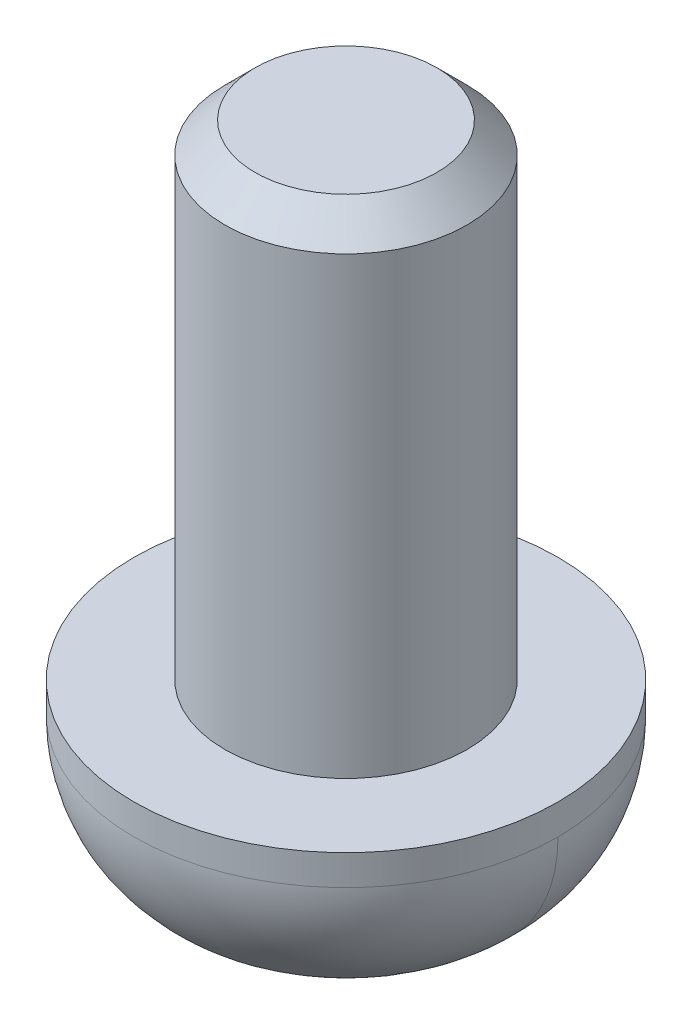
ISO-10303-21;
HEADER;
FILE_DESCRIPTION(('STEP AP214'),'2;1');
FILE_NAME('part.step','',(''),(''),'','','');
FILE_SCHEMA(('AUTOMOTIVE_DESIGN { 1 0 10303 214 1 1 1 1 }'));
ENDSEC;
DATA;
#1=APPLICATION_CONTEXT('core data for automotive mechanical design processes');
#2=APPLICATION_PROTOCOL_DEFINITION('international standard','automotive_design',2000,#1);
#3=PRODUCT_CONTEXT('',#1,'mechanical');
#4=PRODUCT('Part','Part','',(#3));
#5=PRODUCT_RELATED_PRODUCT_CATEGORY('part','',(#4));
#6=PRODUCT_DEFINITION_FORMATION('','',#4);
#7=PRODUCT_DEFINITION_CONTEXT('part definition',#1,'design');
#8=PRODUCT_DEFINITION('design','',#6,#7);
#9=PRODUCT_DEFINITION_SHAPE('','',#8);
#10=(LENGTH_UNIT() NAMED_UNIT(*) SI_UNIT(.MILLI.,.METRE.));
#11=(NAMED_UNIT(*) PLANE_ANGLE_UNIT() SI_UNIT($,.RADIAN.));
#12=(NAMED_UNIT(*) SI_UNIT($,.STERADIAN.) SOLID_ANGLE_UNIT());
#13=UNCERTAINTY_MEASURE_WITH_UNIT(LENGTH_MEASURE(1.E-05),#10,'distance_accuracy_value','');
#14=(GEOMETRIC_REPRESENTATION_CONTEXT(3) GLOBAL_UNCERTAINTY_ASSIGNED_CONTEXT((#13)) GLOBAL_UNIT_ASSIGNED_CONTEXT((#10,
#11,#12)) REPRESENTATION_CONTEXT('',''));
#15=CARTESIAN_POINT('',(0.,0.,0.));
#16=DIRECTION('',(0.,0.,1.));
#17=DIRECTION('',(1.,0.,0.));
#18=AXIS2_PLACEMENT_3D('',#15,#16,#17);
#19=CARTESIAN_POINT('',(-17.359,89.3,19.441));
#20=DIRECTION('',(0.,1.,0.));
#21=DIRECTION('',(0.,0.,1.));
#22=AXIS2_PLACEMENT_3D('',#19,#20,#21);
#23=PLANE('',#22);
#24=CARTESIAN_POINT('',(-16.6,89.3,20.2));
#25=DIRECTION('',(0.,-1.,0.));
#26=DIRECTION('',(0.,0.,-1.));
#27=AXIS2_PLACEMENT_3D('',#24,#25,#26);
#28=CIRCLE('',#27,0.749999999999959);
#29=CARTESIAN_POINT('',(-16.6,89.3,19.45));
#30=VERTEX_POINT('',#29);
#31=EDGE_CURVE('E22',#30,#30,#28,.F.);
#32=ORIENTED_EDGE('',*,*,#31,.T.);
#33=EDGE_LOOP('',(#32));
#34=FACE_BOUND('',#33,.T.);
#35=ADVANCED_FACE('F17',(#34),#23,.T.);
#36=CARTESIAN_POINT('',(-16.6,89.3,20.2));
#37=DIRECTION('',(0.,-1.,0.));
#38=DIRECTION('',(0.,0.,-1.));
#39=AXIS2_PLACEMENT_3D('',#36,#37,#38);
#40=CONICAL_SURFACE('',#39,0.750000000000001,0.785398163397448);
#41=CARTESIAN_POINT('',(-16.6,89.05,20.2));
#42=DIRECTION('',(0.,1.,0.));
#43=DIRECTION('',(-1.,0.,0.));
#44=AXIS2_PLACEMENT_3D('',#41,#42,#43);
#45=CIRCLE('',#44,1.);
#46=CARTESIAN_POINT('',(-17.6,89.05,20.2));
#47=VERTEX_POINT('',#46);
#48=EDGE_CURVE('E216',#47,#47,#45,.T.);
#49=ORIENTED_EDGE('',*,*,#48,.T.);
#50=EDGE_LOOP('',(#49));
#51=FACE_BOUND('',#50,.T.);
#52=ORIENTED_EDGE('',*,*,#31,.F.);
#53=EDGE_LOOP('',(#52));
#54=FACE_BOUND('',#53,.T.);
#55=ADVANCED_FACE('F144',(#51,#54),#40,.T.);
#56=CARTESIAN_POINT('',(-16.6,85.3,20.2));
#57=DIRECTION('',(0.,1.,0.));
#58=DIRECTION('',(0.,0.,1.));
#59=AXIS2_PLACEMENT_3D('',#56,#57,#58);
#60=CYLINDRICAL_SURFACE('',#59,1.);
#61=CARTESIAN_POINT('',(-16.6,85.3,20.2));
#62=DIRECTION('',(0.,1.,0.));
#63=DIRECTION('',(0.,0.,1.));
#64=AXIS2_PLACEMENT_3D('',#61,#62,#63);
#65=CIRCLE('',#64,1.);
#66=CARTESIAN_POINT('',(-16.6,85.3,21.2));
#67=VERTEX_POINT('',#66);
#68=EDGE_CURVE('E201',#67,#67,#65,.F.);
#69=ORIENTED_EDGE('',*,*,#68,.F.);
#70=EDGE_LOOP('',(#69));
#71=FACE_BOUND('',#70,.T.);
#72=ORIENTED_EDGE('',*,*,#48,.F.);
#73=EDGE_LOOP('',(#72));
#74=FACE_BOUND('',#73,.T.);
#75=ADVANCED_FACE('F149',(#71,#74),#60,.T.);
#76=CARTESIAN_POINT('',(-17.35055535,84.6,19.55));
#77=DIRECTION('',(0.,-1.,0.));
#78=DIRECTION('',(1.,0.,0.));
#79=AXIS2_PLACEMENT_3D('',#76,#77,#78);
#80=PLANE('',#79);
#81=DIRECTION('',(0.500000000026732,0.,-0.866025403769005));
#82=VECTOR('',#81,1.);
#83=CARTESIAN_POINT('',(-17.1629165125,84.6,19.875));
#84=LINE('',#83,#82);
#85=CARTESIAN_POINT('',(-17.3505553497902,84.6,20.2000000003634));
#86=VERTEX_POINT('',#85);
#87=CARTESIAN_POINT('',(-16.975277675,84.6,19.55));
#88=VERTEX_POINT('',#87);
#89=EDGE_CURVE('E87',#86,#88,#84,.T.);
#90=ORIENTED_EDGE('',*,*,#89,.T.);
#91=DIRECTION('',(1.,0.,0.));
#92=VECTOR('',#91,1.);
#93=CARTESIAN_POINT('',(-16.6,84.6,19.55));
#94=LINE('',#93,#92);
#95=CARTESIAN_POINT('',(-16.224722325,84.6,19.55));
#96=VERTEX_POINT('',#95);
#97=EDGE_CURVE('E179',#88,#96,#94,.T.);
#98=ORIENTED_EDGE('',*,*,#97,.T.);
#99=DIRECTION('',(0.500000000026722,0.,0.866025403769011));
#100=VECTOR('',#99,1.);
#101=CARTESIAN_POINT('',(-16.0370834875,84.6,19.875));
#102=LINE('',#101,#100);
#103=CARTESIAN_POINT('',(-15.8494446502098,84.6,20.1999999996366));
#104=VERTEX_POINT('',#103);
#105=EDGE_CURVE('E120',#96,#104,#102,.T.);
#106=ORIENTED_EDGE('',*,*,#105,.T.);
#107=DIRECTION('',(-0.50000000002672,0.,0.866025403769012));
#108=VECTOR('',#107,1.);
#109=CARTESIAN_POINT('',(-16.0370834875,84.6,20.525));
#110=LINE('',#109,#108);
#111=CARTESIAN_POINT('',(-16.224722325,84.6,20.85));
#112=VERTEX_POINT('',#111);
#113=EDGE_CURVE('E114',#104,#112,#110,.T.);
#114=ORIENTED_EDGE('',*,*,#113,.T.);
#115=DIRECTION('',(-1.,0.,0.));
#116=VECTOR('',#115,1.);
#117=CARTESIAN_POINT('',(-16.6,84.6,20.85));
#118=LINE('',#117,#116);
#119=CARTESIAN_POINT('',(-16.975277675,84.6,20.85));
#120=VERTEX_POINT('',#119);
#121=EDGE_CURVE('E90',#112,#120,#118,.T.);
#122=ORIENTED_EDGE('',*,*,#121,.T.);
#123=DIRECTION('',(-0.50000000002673,0.,-0.866025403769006));
#124=VECTOR('',#123,1.);
#125=CARTESIAN_POINT('',(-17.1629165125,84.6,20.525));
#126=LINE('',#125,#124);
#127=EDGE_CURVE('E84',#120,#86,#126,.T.);
#128=ORIENTED_EDGE('',*,*,#127,.T.);
#129=EDGE_LOOP('',(#90,#98,#106,#114,#122,#128));
#130=FACE_BOUND('',#129,.T.);
#131=ADVANCED_FACE('F86',(#130),#80,.T.);
#132=CARTESIAN_POINT('',(-18.371,85.3,18.429));
#133=DIRECTION('',(0.,1.,0.));
#134=DIRECTION('',(0.,0.,1.));
#135=AXIS2_PLACEMENT_3D('',#132,#133,#134);
#136=PLANE('',#135);
#137=ORIENTED_EDGE('',*,*,#68,.T.);
#138=EDGE_LOOP('',(#137));
#139=FACE_BOUND('',#138,.T.);
#140=CARTESIAN_POINT('',(-16.6,85.3,20.2));
#141=DIRECTION('',(0.,1.,0.));
#142=DIRECTION('',(0.,0.,1.));
#143=AXIS2_PLACEMENT_3D('',#140,#141,#142);
#144=CIRCLE('',#143,1.75);
#145=CARTESIAN_POINT('',(-16.6,85.3,21.95));
#146=VERTEX_POINT('',#145);
#147=EDGE_CURVE('E185',#146,#146,#144,.T.);
#148=ORIENTED_EDGE('',*,*,#147,.T.);
#149=EDGE_LOOP('',(#148));
#150=FACE_BOUND('',#149,.T.);
#151=ADVANCED_FACE('F148',(#139,#150),#136,.T.);
#152=CARTESIAN_POINT('',(-18.35,85.05,20.2));
#153=CARTESIAN_POINT('',(-18.35,85.05,23.7));
#154=CARTESIAN_POINT('',(-14.85,85.05,23.7));
#155=CARTESIAN_POINT('',(-14.85,85.05,20.2));
#156=CARTESIAN_POINT('',(-18.35,84.616262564,20.2));
#157=CARTESIAN_POINT('',(-18.35,84.616262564,23.699999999));
#158=CARTESIAN_POINT('',(-14.85,84.616262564,23.699999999));
#159=CARTESIAN_POINT('',(-14.85,84.616262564,20.2));
#160=CARTESIAN_POINT('',(-18.142572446,84.235340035,20.2));
#161=CARTESIAN_POINT('',(-18.142572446,84.235340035,23.285144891));
#162=CARTESIAN_POINT('',(-15.057427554,84.235340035,23.285144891));
#163=CARTESIAN_POINT('',(-15.057427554,84.235340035,20.2));
#164=CARTESIAN_POINT('',(-17.778233,84.,20.2));
#165=CARTESIAN_POINT('',(-17.778233,84.,22.556466));
#166=CARTESIAN_POINT('',(-15.421767,84.,22.556466));
#167=CARTESIAN_POINT('',(-15.421767,84.,20.2));
#168=(BOUNDED_SURFACE() B_SPLINE_SURFACE(3,3,((#152,#153,#154,#155),(#156,#157,#158,#159),(#160,
#161,#162,#163),(#164,#165,#166,#167)),.UNSPECIFIED.,.F.,.F.,
.F.) B_SPLINE_SURFACE_WITH_KNOTS((4,4),(4,4),(0.,1.),(0.,1.),
.UNSPECIFIED.) GEOMETRIC_REPRESENTATION_ITEM() RATIONAL_B_SPLINE_SURFACE(((1.,0.333333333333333,
0.333333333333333,1.),(0.918821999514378,0.306273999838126,0.306273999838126,0.918821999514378),
(0.918821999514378,0.306273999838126,0.306273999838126,0.918821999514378),(1.,0.333333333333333,
0.333333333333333,1.))) REPRESENTATION_ITEM('') SURFACE());
#169=CARTESIAN_POINT('',(-18.35,85.05,20.2));
#170=CARTESIAN_POINT('',(-18.35,84.616262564,20.2));
#171=CARTESIAN_POINT('',(-18.142572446,84.235340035,20.2));
#172=CARTESIAN_POINT('',(-17.778233,84.,20.2));
#173=(BOUNDED_CURVE() B_SPLINE_CURVE(3,(#169,#170,#171,#172),.UNSPECIFIED.,.F.,
.F.) B_SPLINE_CURVE_WITH_KNOTS((4,4),(0.,1.),
.UNSPECIFIED.) CURVE() GEOMETRIC_REPRESENTATION_ITEM() RATIONAL_B_SPLINE_CURVE((1.,
0.918821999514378,0.918821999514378,1.)) REPRESENTATION_ITEM(''));
#174=CARTESIAN_POINT('',(-18.35,85.05,20.1999999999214));
#175=VERTEX_POINT('',#174);
#176=CARTESIAN_POINT('',(-17.778233,84.,20.2));
#177=VERTEX_POINT('',#176);
#178=EDGE_CURVE('E35',#175,#177,#173,.T.);
#179=CARTESIAN_POINT('',(-15.421767,84.,20.2));
#180=CARTESIAN_POINT('',(-15.421766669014,84.,20.2331485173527));
#181=CARTESIAN_POINT('',(-15.4231665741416,84.,20.2662823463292));
#182=CARTESIAN_POINT('',(-15.4287506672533,84.,20.3323111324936));
#183=CARTESIAN_POINT('',(-15.432934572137,84.,20.3652061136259));
#184=CARTESIAN_POINT('',(-15.4496209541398,84.,20.463126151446));
#185=CARTESIAN_POINT('',(-15.4662582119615,84.,20.5274916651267));
#186=CARTESIAN_POINT('',(-15.5101228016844,84.,20.6525407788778));
#187=CARTESIAN_POINT('',(-15.537355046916,84.,20.7132226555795));
#188=CARTESIAN_POINT('',(-15.5855026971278,84.,20.8001065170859));
#189=CARTESIAN_POINT('',(-15.6027707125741,84.,20.8283807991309));
#190=CARTESIAN_POINT('',(-15.6396405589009,84.,20.8834036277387));
#191=CARTESIAN_POINT('',(-15.6592446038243,84.,20.910150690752));
#192=CARTESIAN_POINT('',(-15.7213157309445,84.,20.9877340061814));
#193=CARTESIAN_POINT('',(-15.767083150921,84.,21.0359868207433));
#194=CARTESIAN_POINT('',(-15.8660781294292,84.,21.1241121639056));
#195=CARTESIAN_POINT('',(-15.9193057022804,84.,21.1639846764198));
#196=CARTESIAN_POINT('',(-16.0035583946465,84.,21.2166574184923));
#197=CARTESIAN_POINT('',(-16.0323995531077,84.,21.2330346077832));
#198=CARTESIAN_POINT('',(-16.0913289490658,84.,21.2632887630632));
#199=CARTESIAN_POINT('',(-16.1214159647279,84.,21.2771681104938));
#200=CARTESIAN_POINT('',(-16.2132897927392,84.,21.3149279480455));
#201=CARTESIAN_POINT('',(-16.276716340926,83.9999999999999,21.3349470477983));
#202=CARTESIAN_POINT('',(-16.4059987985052,83.9999999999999,21.3640415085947));
#203=CARTESIAN_POINT('',(-16.4718547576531,84.,21.3731166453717));
#204=CARTESIAN_POINT('',(-16.6041653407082,84.,21.3800856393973));
#205=CARTESIAN_POINT('',(-16.6706199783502,84.,21.3779792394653));
#206=CARTESIAN_POINT('',(-16.8022311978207,84.,21.3626369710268));
#207=CARTESIAN_POINT('',(-16.8673877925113,84.,21.349401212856));
#208=CARTESIAN_POINT('',(-16.9945476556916,84.,21.3121852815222));
#209=CARTESIAN_POINT('',(-17.0565509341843,84.,21.2882051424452));
#210=CARTESIAN_POINT('',(-17.1756784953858,84.,21.2301513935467));
#211=CARTESIAN_POINT('',(-17.2328026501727,84.,21.1960775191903));
#212=CARTESIAN_POINT('',(-17.3135283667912,84.,21.1381955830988));
#213=CARTESIAN_POINT('',(-17.3396144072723,84.,21.1177688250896));
#214=CARTESIAN_POINT('',(-17.3900015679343,84.,21.0747732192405));
#215=CARTESIAN_POINT('',(-17.4143009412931,84.,21.0522023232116));
#216=CARTESIAN_POINT('',(-17.4841783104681,84.,20.9815625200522));
#217=CARTESIAN_POINT('',(-17.5268078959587,84.,20.9305145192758));
#218=CARTESIAN_POINT('',(-17.6028775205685,84.,20.8219817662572));
#219=CARTESIAN_POINT('',(-17.636317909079,84.,20.7644972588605));
#220=CARTESIAN_POINT('',(-17.6788898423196,84.,20.6746921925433));
#221=CARTESIAN_POINT('',(-17.6918251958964,84.,20.6441271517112));
#222=CARTESIAN_POINT('',(-17.7150659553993,84.,20.5820468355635));
#223=CARTESIAN_POINT('',(-17.7253734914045,84.,20.5505323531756));
#224=CARTESIAN_POINT('',(-17.7522246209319,84.,20.4549067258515));
#225=CARTESIAN_POINT('',(-17.7647545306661,84.,20.389591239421));
#226=CARTESIAN_POINT('',(-17.7738866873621,84.,20.3032227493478));
#227=CARTESIAN_POINT('',(-17.7755173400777,84.,20.2825942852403));
#228=CARTESIAN_POINT('',(-17.7776887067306,84.,20.2413142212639));
#229=CARTESIAN_POINT('',(-17.7782312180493,84.,20.2206627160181));
#230=CARTESIAN_POINT('',(-17.778233,84.,20.2));
#231=B_SPLINE_CURVE_WITH_KNOTS('',3,(#179,#180,#181,#182,#183,#184,#185,#186,#187,#188,#189,
#190,#191,#192,#193,#194,#195,#196,#197,#198,#199,#200,#201,#202,#203,#204,#205,#206,#207,#208,
#209,#210,#211,#212,#213,#214,#215,#216,#217,#218,#219,#220,#221,#222,#223,#224,#225,#226,#227,
#228,#229,#230),.UNSPECIFIED.,.F.,.F.,(4,2,2,2,2,2,2,2,2,2,2,2,2,2,2,2,2,2,2,2,2,2,2,2,2,4),(0.,
0.0993868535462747,0.198763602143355,0.397205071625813,0.595738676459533,0.695026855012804,
0.794409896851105,0.99292381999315,1.19143812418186,1.29083432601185,1.39013525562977,
1.58864301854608,1.78715484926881,1.98567124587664,2.18418567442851,2.38269947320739,
2.58121847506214,2.68051349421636,2.77990433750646,2.97842222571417,3.17693256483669,
3.27639469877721,3.37577595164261,3.57413784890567,3.63619904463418,3.69815764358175),.UNSPECIFIED.);
#232=CARTESIAN_POINT('',(-15.421767,84.,20.2));
#233=VERTEX_POINT('',#232);
#234=EDGE_CURVE('E228',#233,#177,#231,.T.);
#235=CARTESIAN_POINT('',(-14.85,85.05,20.2));
#236=CARTESIAN_POINT('',(-14.85,84.616262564,20.2));
#237=CARTESIAN_POINT('',(-15.057427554,84.235340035,20.2));
#238=CARTESIAN_POINT('',(-15.421767,84.,20.2));
#239=(BOUNDED_CURVE() B_SPLINE_CURVE(3,(#235,#236,#237,#238),.UNSPECIFIED.,.F.,
.F.) B_SPLINE_CURVE_WITH_KNOTS((4,4),(0.,1.),
.UNSPECIFIED.) CURVE() GEOMETRIC_REPRESENTATION_ITEM() RATIONAL_B_SPLINE_CURVE((1.,
0.918821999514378,0.918821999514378,1.)) REPRESENTATION_ITEM(''));
#240=CARTESIAN_POINT('',(-14.85,85.05,20.1999999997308));
#241=VERTEX_POINT('',#240);
#242=EDGE_CURVE('E42',#233,#241,#239,.F.);
#243=CARTESIAN_POINT('',(-16.6,85.05,20.2));
#244=DIRECTION('',(0.,-1.,0.));
#245=DIRECTION('',(0.,0.,-1.));
#246=AXIS2_PLACEMENT_3D('',#243,#244,#245);
#247=CIRCLE('',#246,1.75);
#248=EDGE_CURVE('E192',#241,#175,#247,.T.);
#249=ORIENTED_EDGE('',*,*,#178,.T.);
#250=ORIENTED_EDGE('',*,*,#234,.F.);
#251=ORIENTED_EDGE('',*,*,#242,.T.);
#252=ORIENTED_EDGE('',*,*,#248,.T.);
#253=EDGE_LOOP('',(#249,#250,#251,#252));
#254=FACE_BOUND('',#253,.T.);
#255=ADVANCED_FACE('F152',(#254),#168,.T.);
#256=CARTESIAN_POINT('',(-16.975277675,84.,19.55));
#257=DIRECTION('',(-0.866025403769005,0.,-0.500000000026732));
#258=DIRECTION('',(-0.500000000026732,0.,0.866025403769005));
#259=AXIS2_PLACEMENT_3D('',#256,#257,#258);
#260=PLANE('',#259);
#261=ORIENTED_EDGE('',*,*,#89,.F.);
#262=DIRECTION('',(0.,-1.,0.));
#263=VECTOR('',#262,1.);
#264=CARTESIAN_POINT('',(-17.35055535,84.3,20.2));
#265=LINE('',#264,#263);
#266=CARTESIAN_POINT('',(-17.3505553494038,84.,20.1999999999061));
#267=VERTEX_POINT('',#266);
#268=EDGE_CURVE('E94',#86,#267,#265,.T.);
#269=ORIENTED_EDGE('',*,*,#268,.T.);
#270=DIRECTION('',(-0.499999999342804,0.,0.866025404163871));
#271=VECTOR('',#270,1.);
#272=CARTESIAN_POINT('',(-16.9752776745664,84.,19.5499999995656));
#273=LINE('',#272,#271);
#274=CARTESIAN_POINT('',(-16.9752776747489,84.,19.5499999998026));
#275=VERTEX_POINT('',#274);
#276=EDGE_CURVE('E226',#275,#267,#273,.T.);
#277=ORIENTED_EDGE('',*,*,#276,.F.);
#278=DIRECTION('',(0.,1.,0.));
#279=VECTOR('',#278,1.);
#280=CARTESIAN_POINT('',(-16.975277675,84.3,19.55));
#281=LINE('',#280,#279);
#282=EDGE_CURVE('E100',#275,#88,#281,.T.);
#283=ORIENTED_EDGE('',*,*,#282,.T.);
#284=EDGE_LOOP('',(#261,#269,#277,#283));
#285=FACE_BOUND('',#284,.T.);
#286=ADVANCED_FACE('F97',(#285),#260,.F.);
#287=CARTESIAN_POINT('',(-17.35055535,84.,20.2));
#288=DIRECTION('',(-0.866025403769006,0.,0.50000000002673));
#289=DIRECTION('',(0.50000000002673,0.,0.866025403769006));
#290=AXIS2_PLACEMENT_3D('',#287,#288,#289);
#291=PLANE('',#290);
#292=ORIENTED_EDGE('',*,*,#127,.F.);
#293=DIRECTION('',(0.,-1.,0.));
#294=VECTOR('',#293,1.);
#295=CARTESIAN_POINT('',(-16.975277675,84.3,20.85));
#296=LINE('',#295,#294);
#297=CARTESIAN_POINT('',(-16.9752776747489,84.,20.8500000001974));
#298=VERTEX_POINT('',#297);
#299=EDGE_CURVE('E108',#120,#298,#296,.T.);
#300=ORIENTED_EDGE('',*,*,#299,.T.);
#301=DIRECTION('',(0.499999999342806,0.,0.86602540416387));
#302=VECTOR('',#301,1.);
#303=CARTESIAN_POINT('',(-17.3505553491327,84.,20.2));
#304=LINE('',#303,#302);
#305=EDGE_CURVE('E105',#267,#298,#304,.T.);
#306=ORIENTED_EDGE('',*,*,#305,.F.);
#307=ORIENTED_EDGE('',*,*,#268,.F.);
#308=EDGE_LOOP('',(#292,#300,#306,#307));
#309=FACE_BOUND('',#308,.T.);
#310=ADVANCED_FACE('F103',(#309),#291,.F.);
#311=CARTESIAN_POINT('',(-16.975277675,84.6,20.85));
#312=DIRECTION('',(0.,0.,1.));
#313=DIRECTION('',(0.,-1.,0.));
#314=AXIS2_PLACEMENT_3D('',#311,#312,#313);
#315=PLANE('',#314);
#316=ORIENTED_EDGE('',*,*,#121,.F.);
#317=DIRECTION('',(0.,-1.,0.));
#318=VECTOR('',#317,1.);
#319=CARTESIAN_POINT('',(-16.224722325,84.3,20.85));
#320=LINE('',#319,#318);
#321=CARTESIAN_POINT('',(-16.2247223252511,84.,20.8500000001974));
#322=VERTEX_POINT('',#321);
#323=EDGE_CURVE('E119',#112,#322,#320,.T.);
#324=ORIENTED_EDGE('',*,*,#323,.T.);
#325=DIRECTION('',(1.,0.,0.));
#326=VECTOR('',#325,1.);
#327=CARTESIAN_POINT('',(-16.6,84.,20.8500000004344));
#328=LINE('',#327,#326);
#329=EDGE_CURVE('E115',#298,#322,#328,.T.);
#330=ORIENTED_EDGE('',*,*,#329,.F.);
#331=ORIENTED_EDGE('',*,*,#299,.F.);
#332=EDGE_LOOP('',(#316,#324,#330,#331));
#333=FACE_BOUND('',#332,.T.);
#334=ADVANCED_FACE('F158',(#333),#315,.F.);
#335=CARTESIAN_POINT('',(-16.224722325,84.,20.85));
#336=DIRECTION('',(0.866025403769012,0.,0.50000000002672));
#337=DIRECTION('',(0.50000000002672,0.,-0.866025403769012));
#338=AXIS2_PLACEMENT_3D('',#335,#336,#337);
#339=PLANE('',#338);
#340=ORIENTED_EDGE('',*,*,#113,.F.);
#341=DIRECTION('',(0.,-1.,0.));
#342=VECTOR('',#341,1.);
#343=CARTESIAN_POINT('',(-15.84944465,84.3,20.2));
#344=LINE('',#343,#342);
#345=CARTESIAN_POINT('',(-15.8494446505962,84.,20.1999999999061));
#346=VERTEX_POINT('',#345);
#347=EDGE_CURVE('E187',#104,#346,#344,.T.);
#348=ORIENTED_EDGE('',*,*,#347,.T.);
#349=DIRECTION('',(0.499999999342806,0.,-0.86602540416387));
#350=VECTOR('',#349,1.);
#351=CARTESIAN_POINT('',(-16.2247223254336,84.,20.8500000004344));
#352=LINE('',#351,#350);
#353=EDGE_CURVE('E118',#322,#346,#352,.T.);
#354=ORIENTED_EDGE('',*,*,#353,.F.);
#355=ORIENTED_EDGE('',*,*,#323,.F.);
#356=EDGE_LOOP('',(#340,#348,#354,#355));
#357=FACE_BOUND('',#356,.T.);
#358=ADVANCED_FACE('F161',(#357),#339,.F.);
#359=CARTESIAN_POINT('',(-15.84944465,84.,20.2));
#360=DIRECTION('',(0.866025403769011,0.,-0.500000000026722));
#361=DIRECTION('',(-0.500000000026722,0.,-0.866025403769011));
#362=AXIS2_PLACEMENT_3D('',#359,#360,#361);
#363=PLANE('',#362);
#364=ORIENTED_EDGE('',*,*,#105,.F.);
#365=DIRECTION('',(0.,-1.,0.));
#366=VECTOR('',#365,1.);
#367=CARTESIAN_POINT('',(-16.224722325,84.3,19.55));
#368=LINE('',#367,#366);
#369=CARTESIAN_POINT('',(-16.2247223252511,84.,19.5499999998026));
#370=VERTEX_POINT('',#369);
#371=EDGE_CURVE('E182',#96,#370,#368,.T.);
#372=ORIENTED_EDGE('',*,*,#371,.T.);
#373=DIRECTION('',(-0.499999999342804,0.,-0.866025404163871));
#374=VECTOR('',#373,1.);
#375=CARTESIAN_POINT('',(-15.8494446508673,84.,20.2));
#376=LINE('',#375,#374);
#377=EDGE_CURVE('E126',#346,#370,#376,.T.);
#378=ORIENTED_EDGE('',*,*,#377,.F.);
#379=ORIENTED_EDGE('',*,*,#347,.F.);
#380=EDGE_LOOP('',(#364,#372,#378,#379));
#381=FACE_BOUND('',#380,.T.);
#382=ADVANCED_FACE('F165',(#381),#363,.F.);
#383=CARTESIAN_POINT('',(-16.224722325,84.,19.55));
#384=DIRECTION('',(0.,0.,-1.));
#385=DIRECTION('',(-1.,0.,0.));
#386=AXIS2_PLACEMENT_3D('',#383,#384,#385);
#387=PLANE('',#386);
#388=ORIENTED_EDGE('',*,*,#97,.F.);
#389=ORIENTED_EDGE('',*,*,#282,.F.);
#390=DIRECTION('',(-1.,0.,0.));
#391=VECTOR('',#390,1.);
#392=CARTESIAN_POINT('',(-16.6,84.,19.5499999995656));
#393=LINE('',#392,#391);
#394=EDGE_CURVE('E210',#370,#275,#393,.T.);
#395=ORIENTED_EDGE('',*,*,#394,.F.);
#396=ORIENTED_EDGE('',*,*,#371,.F.);
#397=EDGE_LOOP('',(#388,#389,#395,#396));
#398=FACE_BOUND('',#397,.T.);
#399=ADVANCED_FACE('F168',(#398),#387,.F.);
#400=CARTESIAN_POINT('',(-16.6,85.05,20.2));
#401=DIRECTION('',(0.,1.,0.));
#402=DIRECTION('',(0.,0.,1.));
#403=AXIS2_PLACEMENT_3D('',#400,#401,#402);
#404=CYLINDRICAL_SURFACE('',#403,1.75);
#405=ORIENTED_EDGE('',*,*,#147,.F.);
#406=EDGE_LOOP('',(#405));
#407=FACE_BOUND('',#406,.T.);
#408=CARTESIAN_POINT('',(-16.6,85.05,20.2));
#409=DIRECTION('',(0.,-1.,0.));
#410=DIRECTION('',(0.,0.,-1.));
#411=AXIS2_PLACEMENT_3D('',#408,#409,#410);
#412=CIRCLE('',#411,1.75);
#413=EDGE_CURVE('E27',#175,#241,#412,.T.);
#414=ORIENTED_EDGE('',*,*,#413,.F.);
#415=ORIENTED_EDGE('',*,*,#248,.F.);
#416=EDGE_LOOP('',(#414,#415));
#417=FACE_BOUND('',#416,.T.);
#418=ADVANCED_FACE('F135',(#407,#417),#404,.T.);
#419=CARTESIAN_POINT('',(-17.792371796,84.,21.392371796));
#420=DIRECTION('',(0.,-1.,0.));
#421=DIRECTION('',(0.,0.,-1.));
#422=AXIS2_PLACEMENT_3D('',#419,#420,#421);
#423=PLANE('',#422);
#424=ORIENTED_EDGE('',*,*,#377,.T.);
#425=ORIENTED_EDGE('',*,*,#394,.T.);
#426=ORIENTED_EDGE('',*,*,#276,.T.);
#427=ORIENTED_EDGE('',*,*,#305,.T.);
#428=ORIENTED_EDGE('',*,*,#329,.T.);
#429=ORIENTED_EDGE('',*,*,#353,.T.);
#430=EDGE_LOOP('',(#424,#425,#426,#427,#428,#429));
#431=FACE_BOUND('',#430,.T.);
#432=ORIENTED_EDGE('',*,*,#234,.T.);
#433=CARTESIAN_POINT('',(-15.421767,84.,20.2));
#434=CARTESIAN_POINT('',(-15.4217666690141,84.,20.1668514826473));
#435=CARTESIAN_POINT('',(-15.4231665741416,84.,20.1337176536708));
#436=CARTESIAN_POINT('',(-15.4287506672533,84.,20.0676888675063));
#437=CARTESIAN_POINT('',(-15.432934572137,84.,20.0347938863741));
#438=CARTESIAN_POINT('',(-15.4496209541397,84.,19.936873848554));
#439=CARTESIAN_POINT('',(-15.4662582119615,84.,19.8725083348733));
#440=CARTESIAN_POINT('',(-15.5101228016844,84.,19.7474592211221));
#441=CARTESIAN_POINT('',(-15.537355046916,84.,19.6867773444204));
#442=CARTESIAN_POINT('',(-15.5855026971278,84.,19.5998934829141));
#443=CARTESIAN_POINT('',(-15.6027707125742,84.,19.5716192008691));
#444=CARTESIAN_POINT('',(-15.6396405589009,84.,19.5165963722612));
#445=CARTESIAN_POINT('',(-15.6592446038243,84.,19.489849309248));
#446=CARTESIAN_POINT('',(-15.7213157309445,84.,19.4122659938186));
#447=CARTESIAN_POINT('',(-15.767083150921,84.,19.3640131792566));
#448=CARTESIAN_POINT('',(-15.8660781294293,84.,19.2758878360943));
#449=CARTESIAN_POINT('',(-15.9193057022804,84.,19.2360153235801));
#450=CARTESIAN_POINT('',(-16.0035583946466,84.,19.1833425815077));
#451=CARTESIAN_POINT('',(-16.0323995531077,84.,19.1669653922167));
#452=CARTESIAN_POINT('',(-16.0913289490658,84.,19.1367112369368));
#453=CARTESIAN_POINT('',(-16.1214159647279,84.,19.1228318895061));
#454=CARTESIAN_POINT('',(-16.2132897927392,84.,19.0850720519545));
#455=CARTESIAN_POINT('',(-16.2767163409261,84.,19.0650529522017));
#456=CARTESIAN_POINT('',(-16.4059987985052,84.,19.0359584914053));
#457=CARTESIAN_POINT('',(-16.4718547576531,84.,19.0268833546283));
#458=CARTESIAN_POINT('',(-16.6041653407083,84.,19.0199143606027));
#459=CARTESIAN_POINT('',(-16.6706199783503,84.,19.0220207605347));
#460=CARTESIAN_POINT('',(-16.8022311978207,84.,19.0373630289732));
#461=CARTESIAN_POINT('',(-16.8673877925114,84.,19.050598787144));
#462=CARTESIAN_POINT('',(-16.9945476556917,84.,19.0878147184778));
#463=CARTESIAN_POINT('',(-17.0565509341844,84.,19.1117948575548));
#464=CARTESIAN_POINT('',(-17.1756784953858,84.,19.1698486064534));
#465=CARTESIAN_POINT('',(-17.2328026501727,84.,19.2039224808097));
#466=CARTESIAN_POINT('',(-17.3135283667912,84.,19.2618044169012));
#467=CARTESIAN_POINT('',(-17.3396144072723,84.,19.2822311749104));
#468=CARTESIAN_POINT('',(-17.3900015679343,84.,19.3252267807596));
#469=CARTESIAN_POINT('',(-17.4143009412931,84.,19.3477976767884));
#470=CARTESIAN_POINT('',(-17.4841783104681,84.,19.4184374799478));
#471=CARTESIAN_POINT('',(-17.5268078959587,84.,19.4694854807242));
#472=CARTESIAN_POINT('',(-17.6028775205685,84.,19.5780182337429));
#473=CARTESIAN_POINT('',(-17.636317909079,84.,19.6355027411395));
#474=CARTESIAN_POINT('',(-17.6788898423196,84.,19.7253078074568));
#475=CARTESIAN_POINT('',(-17.6918251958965,84.,19.7558728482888));
#476=CARTESIAN_POINT('',(-17.7150659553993,84.,19.8179531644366));
#477=CARTESIAN_POINT('',(-17.7253734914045,84.,19.8494676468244));
#478=CARTESIAN_POINT('',(-17.7522246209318,84.,19.9450932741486));
#479=CARTESIAN_POINT('',(-17.7647545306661,84.,20.010408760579));
#480=CARTESIAN_POINT('',(-17.7738866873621,84.,20.0967772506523));
#481=CARTESIAN_POINT('',(-17.7755173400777,84.,20.1174057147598));
#482=CARTESIAN_POINT('',(-17.7776887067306,84.,20.1586857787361));
#483=CARTESIAN_POINT('',(-17.7782312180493,84.,20.1793372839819));
#484=CARTESIAN_POINT('',(-17.778233,84.,20.2));
#485=B_SPLINE_CURVE_WITH_KNOTS('',3,(#433,#434,#435,#436,#437,#438,#439,#440,#441,#442,#443,
#444,#445,#446,#447,#448,#449,#450,#451,#452,#453,#454,#455,#456,#457,#458,#459,#460,#461,#462,
#463,#464,#465,#466,#467,#468,#469,#470,#471,#472,#473,#474,#475,#476,#477,#478,#479,#480,#481,
#482,#483,#484),.UNSPECIFIED.,.F.,.F.,(4,2,2,2,2,2,2,2,2,2,2,2,2,2,2,2,2,2,2,2,2,2,2,2,2,4),(0.,
0.0993868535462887,0.19876360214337,0.397205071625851,0.595738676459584,0.695026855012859,
0.794409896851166,0.992923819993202,1.19143812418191,1.29083432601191,1.39013525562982,
1.58864301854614,1.78715484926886,1.9856712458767,2.18418567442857,2.38269947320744,
2.58121847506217,2.68051349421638,2.77990433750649,2.97842222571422,3.17693256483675,
3.27639469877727,3.37577595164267,3.57413784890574,3.63619904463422,3.69815764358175),.UNSPECIFIED.);
#486=EDGE_CURVE('E11',#233,#177,#485,.T.);
#487=ORIENTED_EDGE('',*,*,#486,.F.);
#488=EDGE_LOOP('',(#432,#487));
#489=FACE_BOUND('',#488,.T.);
#490=ADVANCED_FACE('F19',(#431,#489),#423,.T.);
#491=CARTESIAN_POINT('',(-14.85,85.05,20.2));
#492=CARTESIAN_POINT('',(-14.85,85.05,16.7));
#493=CARTESIAN_POINT('',(-18.35,85.05,16.7));
#494=CARTESIAN_POINT('',(-18.35,85.05,20.2));
#495=CARTESIAN_POINT('',(-14.85,84.616262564,20.2));
#496=CARTESIAN_POINT('',(-14.85,84.616262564,16.700000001));
#497=CARTESIAN_POINT('',(-18.35,84.616262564,16.700000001));
#498=CARTESIAN_POINT('',(-18.35,84.616262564,20.2));
#499=CARTESIAN_POINT('',(-15.057427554,84.235340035,20.2));
#500=CARTESIAN_POINT('',(-15.057427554,84.235340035,17.114855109));
#501=CARTESIAN_POINT('',(-18.142572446,84.235340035,17.114855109));
#502=CARTESIAN_POINT('',(-18.142572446,84.235340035,20.2));
#503=CARTESIAN_POINT('',(-15.421767,84.,20.2));
#504=CARTESIAN_POINT('',(-15.421767,84.,17.843534));
#505=CARTESIAN_POINT('',(-17.778233,84.,17.843534));
#506=CARTESIAN_POINT('',(-17.778233,84.,20.2));
#507=(BOUNDED_SURFACE() B_SPLINE_SURFACE(3,3,((#491,#492,#493,#494),(#495,#496,#497,#498),(#499,
#500,#501,#502),(#503,#504,#505,#506)),.UNSPECIFIED.,.F.,.F.,
.F.) B_SPLINE_SURFACE_WITH_KNOTS((4,4),(4,4),(0.,1.),(0.,1.),
.UNSPECIFIED.) GEOMETRIC_REPRESENTATION_ITEM() RATIONAL_B_SPLINE_SURFACE(((1.,0.333333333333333,
0.333333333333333,1.),(0.918821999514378,0.306273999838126,0.306273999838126,0.918821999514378),
(0.918821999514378,0.306273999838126,0.306273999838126,0.918821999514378),(1.,0.333333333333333,
0.333333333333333,1.))) REPRESENTATION_ITEM('') SURFACE());
#508=ORIENTED_EDGE('',*,*,#486,.T.);
#509=ORIENTED_EDGE('',*,*,#178,.F.);
#510=ORIENTED_EDGE('',*,*,#413,.T.);
#511=ORIENTED_EDGE('',*,*,#242,.F.);
#512=EDGE_LOOP('',(#508,#509,#510,#511));
#513=FACE_BOUND('',#512,.T.);
#514=ADVANCED_FACE('F128',(#513),#507,.T.);
#515=CLOSED_SHELL('',(#35,#55,#75,#131,#151,#255,#286,#310,#334,#358,#382,#399,#418,#490,#514));
#516=MANIFOLD_SOLID_BREP('B1',#515);
#517=ADVANCED_BREP_SHAPE_REPRESENTATION('',(#18,#516),#14);
#518=SHAPE_DEFINITION_REPRESENTATION(#9,#517);
ENDSEC;
END-ISO-10303-21;
